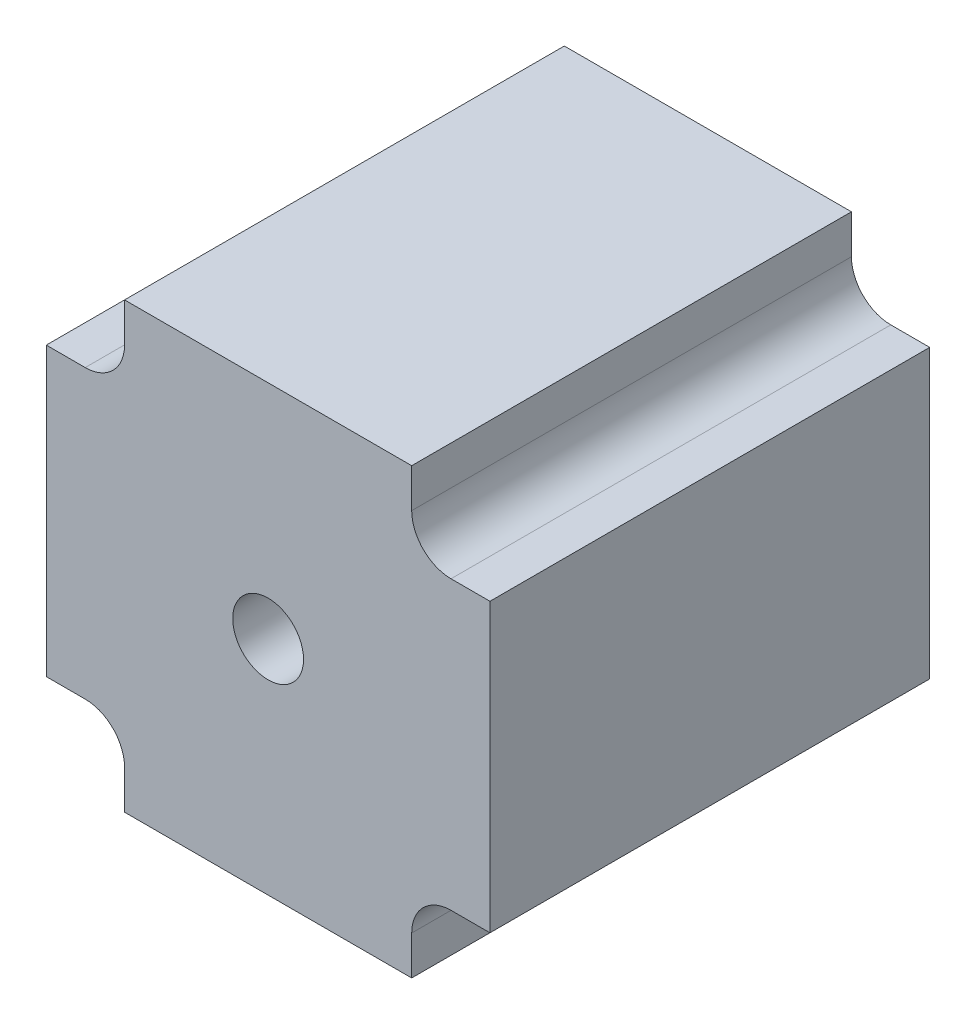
from build123d import *

# Parameters (mm, degrees)
EXTRUDE_1_DEPTH     = 55.9
SKETCH_2_R          = 4.5
CUT_EXTRUDE_1_DEPTH = 55.9
FILLET_1_R          = 5


with BuildPart() as part:
    # Sketch 1 → Extrude 1 (new body)
    with BuildSketch(Plane.XY):
        Polygon((-18.25, 18.25), (-18.25, 28.2), (18.25, 28.2), (18.25, 18.25), (28.2, 18.25), (28.2, -18.25), (18.25, -18.25), (18.25, -28.2), (-18.25, -28.2), (-18.25, -18.25), (-28.2, -18.25), (-28.2, 18.25), align=None)
    extrude(amount=EXTRUDE_1_DEPTH)

    # Sketch 2 → Cut-Extrude 1 (cut)
    with BuildSketch(Plane.XY.offset(55.9)):
        Circle(SKETCH_2_R)
    extrude(amount=-CUT_EXTRUDE_1_DEPTH, mode=Mode.SUBTRACT)

    # Fillet 1
    fillet_1_edges = [part.edges().sort_by_distance(p)[0] for p in [
        (-18.25, 18.25, 27.95),
        (18.25, 18.25, 27.95),
        (18.25, -18.25, 27.95),
        (-18.25, -18.25, 27.95),
    ]]
    fillet(fillet_1_edges, radius=FILLET_1_R)


solid = part.part
